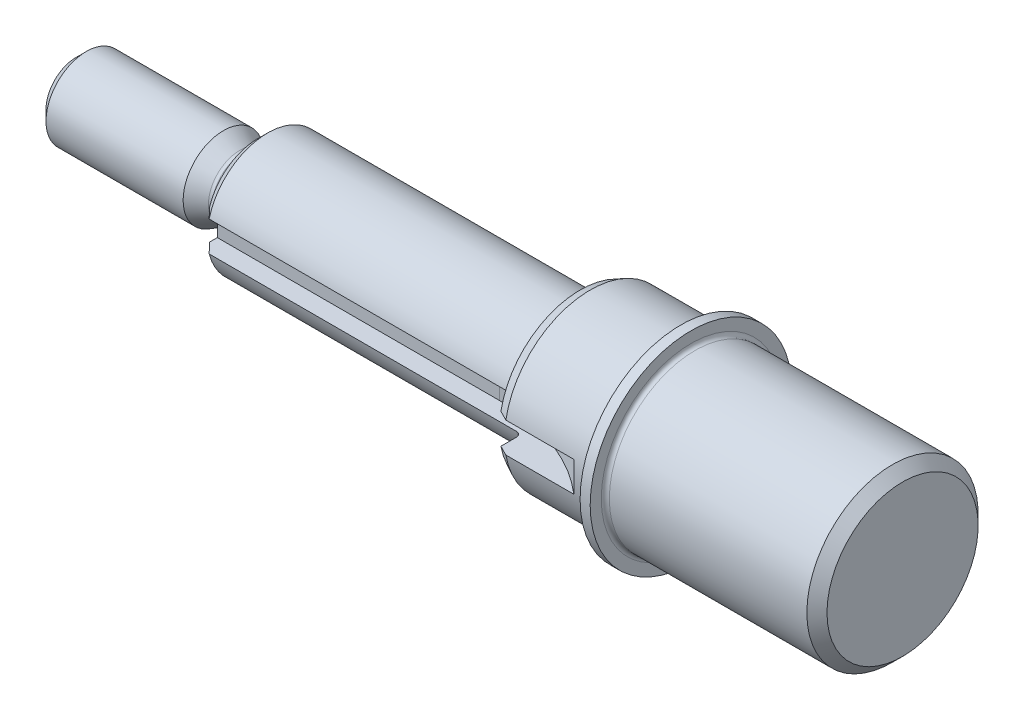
ISO-10303-21;
HEADER;
FILE_DESCRIPTION(('STEP AP214'),'2;1');
FILE_NAME('part.step','',(''),(''),'','','');
FILE_SCHEMA(('AUTOMOTIVE_DESIGN { 1 0 10303 214 1 1 1 1 }'));
ENDSEC;
DATA;
#1=APPLICATION_CONTEXT('core data for automotive mechanical design processes');
#2=APPLICATION_PROTOCOL_DEFINITION('international standard','automotive_design',2000,#1);
#3=PRODUCT_CONTEXT('',#1,'mechanical');
#4=PRODUCT('Part','Part','',(#3));
#5=PRODUCT_RELATED_PRODUCT_CATEGORY('part','',(#4));
#6=PRODUCT_DEFINITION_FORMATION('','',#4);
#7=PRODUCT_DEFINITION_CONTEXT('part definition',#1,'design');
#8=PRODUCT_DEFINITION('design','',#6,#7);
#9=PRODUCT_DEFINITION_SHAPE('','',#8);
#10=(LENGTH_UNIT() NAMED_UNIT(*) SI_UNIT(.MILLI.,.METRE.));
#11=(NAMED_UNIT(*) PLANE_ANGLE_UNIT() SI_UNIT($,.RADIAN.));
#12=(NAMED_UNIT(*) SI_UNIT($,.STERADIAN.) SOLID_ANGLE_UNIT());
#13=UNCERTAINTY_MEASURE_WITH_UNIT(LENGTH_MEASURE(1.E-05),#10,'distance_accuracy_value','');
#14=(GEOMETRIC_REPRESENTATION_CONTEXT(3) GLOBAL_UNCERTAINTY_ASSIGNED_CONTEXT((#13)) GLOBAL_UNIT_ASSIGNED_CONTEXT((#10,
#11,#12)) REPRESENTATION_CONTEXT('',''));
#15=CARTESIAN_POINT('',(0.,0.,0.));
#16=DIRECTION('',(0.,0.,1.));
#17=DIRECTION('',(1.,0.,0.));
#18=AXIS2_PLACEMENT_3D('',#15,#16,#17);
#19=CARTESIAN_POINT('',(0.,0.,0.));
#20=DIRECTION('',(-1.,0.,0.));
#21=DIRECTION('',(0.,0.,1.));
#22=AXIS2_PLACEMENT_3D('',#19,#20,#21);
#23=PLANE('',#22);
#24=CARTESIAN_POINT('',(0.,0.,0.));
#25=DIRECTION('',(-1.,0.,0.));
#26=DIRECTION('',(0.,0.,1.));
#27=AXIS2_PLACEMENT_3D('',#24,#25,#26);
#28=CIRCLE('',#27,7.5);
#29=CARTESIAN_POINT('',(0.,0.,7.5));
#30=VERTEX_POINT('',#29);
#31=EDGE_CURVE('E26',#30,#30,#28,.T.);
#32=ORIENTED_EDGE('',*,*,#31,.F.);
#33=EDGE_LOOP('',(#32));
#34=FACE_BOUND('',#33,.T.);
#35=ADVANCED_FACE('F14',(#34),#23,.F.);
#36=CARTESIAN_POINT('',(0.,0.,0.));
#37=DIRECTION('',(-1.,0.,0.));
#38=DIRECTION('',(0.,0.,1.));
#39=AXIS2_PLACEMENT_3D('',#36,#37,#38);
#40=CONICAL_SURFACE('',#39,7.5,0.785398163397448);
#41=CARTESIAN_POINT('',(-1.,0.,0.));
#42=DIRECTION('',(-1.,0.,0.));
#43=DIRECTION('',(0.,0.,1.));
#44=AXIS2_PLACEMENT_3D('',#41,#42,#43);
#45=CIRCLE('',#44,8.5);
#46=CARTESIAN_POINT('',(-1.,0.,8.5));
#47=VERTEX_POINT('',#46);
#48=EDGE_CURVE('E220',#47,#47,#45,.T.);
#49=ORIENTED_EDGE('',*,*,#48,.F.);
#50=EDGE_LOOP('',(#49));
#51=FACE_BOUND('',#50,.T.);
#52=ORIENTED_EDGE('',*,*,#31,.T.);
#53=EDGE_LOOP('',(#52));
#54=FACE_BOUND('',#53,.T.);
#55=ADVANCED_FACE('F225',(#51,#54),#40,.T.);
#56=CARTESIAN_POINT('',(-25.,0.,0.));
#57=DIRECTION('',(-1.,0.,0.));
#58=DIRECTION('',(0.,0.,1.));
#59=AXIS2_PLACEMENT_3D('',#56,#57,#58);
#60=CYLINDRICAL_SURFACE('',#59,8.5);
#61=CARTESIAN_POINT('',(-20.6,0.,0.));
#62=DIRECTION('',(-1.,0.,0.));
#63=DIRECTION('',(0.,0.,1.));
#64=AXIS2_PLACEMENT_3D('',#61,#62,#63);
#65=CIRCLE('',#64,8.5);
#66=CARTESIAN_POINT('',(-20.6,0.,8.5));
#67=VERTEX_POINT('',#66);
#68=EDGE_CURVE('E217',#67,#67,#65,.T.);
#69=ORIENTED_EDGE('',*,*,#68,.F.);
#70=EDGE_LOOP('',(#69));
#71=FACE_BOUND('',#70,.T.);
#72=ORIENTED_EDGE('',*,*,#48,.T.);
#73=EDGE_LOOP('',(#72));
#74=FACE_BOUND('',#73,.T.);
#75=ADVANCED_FACE('F233',(#71,#74),#60,.T.);
#76=CARTESIAN_POINT('',(-20.6,0.,0.));
#77=DIRECTION('',(-1.,0.,0.));
#78=DIRECTION('',(0.,0.,1.));
#79=AXIS2_PLACEMENT_3D('',#76,#77,#78);
#80=TOROIDAL_SURFACE('',#79,8.9,0.4);
#81=CARTESIAN_POINT('',(-21.,0.,0.));
#82=DIRECTION('',(-1.,0.,0.));
#83=DIRECTION('',(0.,0.,1.));
#84=AXIS2_PLACEMENT_3D('',#81,#82,#83);
#85=CIRCLE('',#84,8.9);
#86=CARTESIAN_POINT('',(-21.,0.,8.9));
#87=VERTEX_POINT('',#86);
#88=EDGE_CURVE('E214',#87,#87,#85,.T.);
#89=ORIENTED_EDGE('',*,*,#88,.F.);
#90=EDGE_LOOP('',(#89));
#91=FACE_BOUND('',#90,.T.);
#92=ORIENTED_EDGE('',*,*,#68,.T.);
#93=EDGE_LOOP('',(#92));
#94=FACE_BOUND('',#93,.T.);
#95=ADVANCED_FACE('F393',(#91,#94),#80,.F.);
#96=CARTESIAN_POINT('',(-21.,0.,8.9));
#97=DIRECTION('',(-1.,0.,0.));
#98=DIRECTION('',(0.,0.,1.));
#99=AXIS2_PLACEMENT_3D('',#96,#97,#98);
#100=PLANE('',#99);
#101=CARTESIAN_POINT('',(-21.,0.,0.));
#102=DIRECTION('',(-1.,0.,0.));
#103=DIRECTION('',(0.,0.,1.));
#104=AXIS2_PLACEMENT_3D('',#101,#102,#103);
#105=CIRCLE('',#104,10.);
#106=CARTESIAN_POINT('',(-21.,0.,10.));
#107=VERTEX_POINT('',#106);
#108=EDGE_CURVE('E211',#107,#107,#105,.T.);
#109=ORIENTED_EDGE('',*,*,#108,.F.);
#110=EDGE_LOOP('',(#109));
#111=FACE_BOUND('',#110,.T.);
#112=ORIENTED_EDGE('',*,*,#88,.T.);
#113=EDGE_LOOP('',(#112));
#114=FACE_BOUND('',#113,.T.);
#115=ADVANCED_FACE('F382',(#111,#114),#100,.F.);
#116=CARTESIAN_POINT('',(-25.,0.,0.));
#117=DIRECTION('',(-1.,0.,0.));
#118=DIRECTION('',(0.,0.,1.));
#119=AXIS2_PLACEMENT_3D('',#116,#117,#118);
#120=CYLINDRICAL_SURFACE('',#119,10.);
#121=CARTESIAN_POINT('',(-22.,0.,0.));
#122=DIRECTION('',(-1.,0.,0.));
#123=DIRECTION('',(0.,0.,1.));
#124=AXIS2_PLACEMENT_3D('',#121,#122,#123);
#125=CIRCLE('',#124,10.);
#126=CARTESIAN_POINT('',(-22.,0.,10.));
#127=VERTEX_POINT('',#126);
#128=EDGE_CURVE('E208',#127,#127,#125,.T.);
#129=ORIENTED_EDGE('',*,*,#128,.F.);
#130=EDGE_LOOP('',(#129));
#131=FACE_BOUND('',#130,.T.);
#132=ORIENTED_EDGE('',*,*,#108,.T.);
#133=EDGE_LOOP('',(#132));
#134=FACE_BOUND('',#133,.T.);
#135=ADVANCED_FACE('F371',(#131,#134),#120,.T.);
#136=CARTESIAN_POINT('',(-22.,0.,10.));
#137=DIRECTION('',(1.,0.,0.));
#138=DIRECTION('',(0.,0.,-1.));
#139=AXIS2_PLACEMENT_3D('',#136,#137,#138);
#140=PLANE('',#139);
#141=CARTESIAN_POINT('',(-22.,0.,0.));
#142=DIRECTION('',(-1.,0.,0.));
#143=DIRECTION('',(0.,0.,1.));
#144=AXIS2_PLACEMENT_3D('',#141,#142,#143);
#145=CIRCLE('',#144,8.89999999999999);
#146=CARTESIAN_POINT('',(-22.,0.,8.89999999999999));
#147=VERTEX_POINT('',#146);
#148=EDGE_CURVE('E205',#147,#147,#145,.T.);
#149=ORIENTED_EDGE('',*,*,#148,.F.);
#150=EDGE_LOOP('',(#149));
#151=FACE_BOUND('',#150,.T.);
#152=ORIENTED_EDGE('',*,*,#128,.T.);
#153=EDGE_LOOP('',(#152));
#154=FACE_BOUND('',#153,.T.);
#155=ADVANCED_FACE('F360',(#151,#154),#140,.F.);
#156=CARTESIAN_POINT('',(-22.4,0.,0.));
#157=DIRECTION('',(-1.,0.,0.));
#158=DIRECTION('',(0.,0.,1.));
#159=AXIS2_PLACEMENT_3D('',#156,#157,#158);
#160=TOROIDAL_SURFACE('',#159,8.89999999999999,0.4);
#161=CARTESIAN_POINT('',(-22.4,0.,0.));
#162=DIRECTION('',(-1.,0.,0.));
#163=DIRECTION('',(0.,0.,1.));
#164=AXIS2_PLACEMENT_3D('',#161,#162,#163);
#165=CIRCLE('',#164,8.49999999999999);
#166=CARTESIAN_POINT('',(-22.4,0.,8.49999999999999));
#167=VERTEX_POINT('',#166);
#168=EDGE_CURVE('E202',#167,#167,#165,.T.);
#169=ORIENTED_EDGE('',*,*,#168,.F.);
#170=EDGE_LOOP('',(#169));
#171=FACE_BOUND('',#170,.T.);
#172=ORIENTED_EDGE('',*,*,#148,.T.);
#173=EDGE_LOOP('',(#172));
#174=FACE_BOUND('',#173,.T.);
#175=ADVANCED_FACE('F242',(#171,#174),#160,.F.);
#176=CARTESIAN_POINT('',(-25.,0.,0.));
#177=DIRECTION('',(-1.,0.,0.));
#178=DIRECTION('',(0.,0.,1.));
#179=AXIS2_PLACEMENT_3D('',#176,#177,#178);
#180=CYLINDRICAL_SURFACE('',#179,8.49999999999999);
#181=CARTESIAN_POINT('',(-24.247110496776,-1.5,8.36660026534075));
#182=CARTESIAN_POINT('',(-24.2148062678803,-1.344734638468,8.39446859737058));
#183=CARTESIAN_POINT('',(-24.1875593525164,-1.18765509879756,8.41813852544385));
#184=CARTESIAN_POINT('',(-24.1432884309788,-0.87095220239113,8.45675809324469));
#185=CARTESIAN_POINT('',(-24.1262677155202,-0.711328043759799,8.47170492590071));
#186=CARTESIAN_POINT('',(-24.1028410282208,-0.394276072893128,8.49230552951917));
#187=CARTESIAN_POINT('',(-24.0962080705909,-0.23687803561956,8.49815800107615));
#188=CARTESIAN_POINT('',(-24.0928717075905,0.0780273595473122,8.50109981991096));
#189=CARTESIAN_POINT('',(-24.0961642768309,0.235534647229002,8.49819271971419));
#190=CARTESIAN_POINT('',(-24.1141738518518,0.578448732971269,8.48233285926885));
#191=CARTESIAN_POINT('',(-24.1308729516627,0.763681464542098,8.46763761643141));
#192=CARTESIAN_POINT('',(-24.1663727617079,1.04037355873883,8.43661167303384));
#193=CARTESIAN_POINT('',(-24.1800763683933,1.13303150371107,8.42466092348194));
#194=CARTESIAN_POINT('',(-24.210979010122,1.31732635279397,8.39781649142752));
#195=CARTESIAN_POINT('',(-24.22817780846,1.408963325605,8.38292300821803));
#196=CARTESIAN_POINT('',(-24.247110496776,1.5,8.36660026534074));
#197=B_SPLINE_CURVE_WITH_KNOTS('',3,(#181,#182,#183,#184,#185,#186,#187,#188,#189,#190,#191,
#192,#193,#194,#195,#196),.UNSPECIFIED.,.F.,.F.,(4,2,2,2,2,2,2,4),(0.,0.482930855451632,
0.966017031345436,1.43839207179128,1.9105755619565,2.46924658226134,2.75242328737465,
3.03558082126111),.UNSPECIFIED.);
#198=CARTESIAN_POINT('',(-24.247110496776,-1.5,8.36660026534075));
#199=VERTEX_POINT('',#198);
#200=CARTESIAN_POINT('',(-24.247110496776,1.5,8.36660026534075));
#201=VERTEX_POINT('',#200);
#202=EDGE_CURVE('E9',#199,#201,#197,.T.);
#203=ORIENTED_EDGE('',*,*,#202,.F.);
#204=DIRECTION('',(-1.,0.,0.));
#205=VECTOR('',#204,1.);
#206=CARTESIAN_POINT('',(-25.,-1.5,8.36660026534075));
#207=LINE('',#206,#205);
#208=CARTESIAN_POINT('',(-31.,-1.5,8.36660026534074));
#209=VERTEX_POINT('',#208);
#210=EDGE_CURVE('E177',#199,#209,#207,.T.);
#211=ORIENTED_EDGE('',*,*,#210,.T.);
#212=CARTESIAN_POINT('',(-31.,0.,0.));
#213=DIRECTION('',(-1.,0.,0.));
#214=DIRECTION('',(0.,0.,1.));
#215=AXIS2_PLACEMENT_3D('',#212,#213,#214);
#216=CIRCLE('',#215,8.49999999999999);
#217=CARTESIAN_POINT('',(-31.,1.5,8.36660026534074));
#218=VERTEX_POINT('',#217);
#219=EDGE_CURVE('E199',#218,#209,#216,.T.);
#220=ORIENTED_EDGE('',*,*,#219,.F.);
#221=DIRECTION('',(-1.,0.,0.));
#222=VECTOR('',#221,1.);
#223=CARTESIAN_POINT('',(-25.,1.5,8.36660026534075));
#224=LINE('',#223,#222);
#225=EDGE_CURVE('E268',#201,#218,#224,.T.);
#226=ORIENTED_EDGE('',*,*,#225,.F.);
#227=EDGE_LOOP('',(#203,#211,#220,#226));
#228=FACE_BOUND('',#227,.T.);
#229=ORIENTED_EDGE('',*,*,#168,.T.);
#230=EDGE_LOOP('',(#229));
#231=FACE_BOUND('',#230,.T.);
#232=ADVANCED_FACE('F237',(#228,#231),#180,.T.);
#233=CARTESIAN_POINT('',(-31.,0.,0.));
#234=DIRECTION('',(1.,0.,0.));
#235=DIRECTION('',(0.,0.,-1.));
#236=AXIS2_PLACEMENT_3D('',#233,#234,#235);
#237=CONICAL_SURFACE('',#236,8.49999999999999,0.4636476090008);
#238=ORIENTED_EDGE('',*,*,#219,.T.);
#239=CARTESIAN_POINT('',(-23.8627978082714,-1.5,11.9750211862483));
#240=CARTESIAN_POINT('',(-24.5056123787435,-1.5,11.6510934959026));
#241=CARTESIAN_POINT('',(-25.148352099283,-1.5,11.3270170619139));
#242=CARTESIAN_POINT('',(-26.4336195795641,-1.5,10.6784438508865));
#243=CARTESIAN_POINT('',(-27.076147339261,-1.5,10.3539470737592));
#244=CARTESIAN_POINT('',(-28.3609157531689,-1.5,9.70441683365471));
#245=CARTESIAN_POINT('',(-29.0031564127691,-1.5,9.37938338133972));
#246=CARTESIAN_POINT('',(-30.2872654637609,-1.5,8.72857844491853));
#247=CARTESIAN_POINT('',(-30.9291338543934,-1.5,8.40280695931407));
#248=CARTESIAN_POINT('',(-32.2123612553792,-1.5,7.75022173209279));
#249=CARTESIAN_POINT('',(-32.8537202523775,-1.5,7.42340796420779));
#250=CARTESIAN_POINT('',(-34.1356668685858,-1.5,6.76827674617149));
#251=CARTESIAN_POINT('',(-34.7762544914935,-1.5,6.43995930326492));
#252=CARTESIAN_POINT('',(-35.7362346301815,-1.5,5.94571337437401));
#253=CARTESIAN_POINT('',(-36.0560815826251,-1.5,5.78066780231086));
#254=CARTESIAN_POINT('',(-36.6953784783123,-1.5,5.44981091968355));
#255=CARTESIAN_POINT('',(-37.0148284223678,-1.5,5.28399961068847));
#256=CARTESIAN_POINT('',(-37.6532178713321,-1.5,4.95138324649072));
#257=CARTESIAN_POINT('',(-37.9721573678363,-1.5,4.78457817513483));
#258=CARTESIAN_POINT('',(-38.6093132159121,-1.5,4.449587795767));
#259=CARTESIAN_POINT('',(-38.9275295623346,-1.5,4.2814024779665));
#260=CARTESIAN_POINT('',(-39.2452783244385,-1.5,4.11233363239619));
#261=B_SPLINE_CURVE_WITH_KNOTS('',3,(#239,#240,#241,#242,#243,#244,#245,#246,#247,#248,#249,
#250,#251,#252,#253,#254,#255,#256,#257,#258,#259,#260),.UNSPECIFIED.,.F.,.F.,(4,2,2,2,2,2,2,2,
2,2,4),(0.,2.15945780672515,4.31891606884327,6.47833193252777,8.63775218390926,10.7972272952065,
12.9566920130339,14.0364499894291,15.1162057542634,16.1959791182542,17.2757601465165),.UNSPECIFIED.);
#262=CARTESIAN_POINT('',(-32.,-1.5,7.85811682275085));
#263=VERTEX_POINT('',#262);
#264=EDGE_CURVE('E39',#209,#263,#261,.T.);
#265=ORIENTED_EDGE('',*,*,#264,.T.);
#266=CARTESIAN_POINT('',(-32.,0.,0.));
#267=DIRECTION('',(-1.,0.,0.));
#268=DIRECTION('',(0.,0.,1.));
#269=AXIS2_PLACEMENT_3D('',#266,#267,#268);
#270=CIRCLE('',#269,7.99999999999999);
#271=CARTESIAN_POINT('',(-32.,1.5,7.85811682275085));
#272=VERTEX_POINT('',#271);
#273=EDGE_CURVE('E196',#272,#263,#270,.T.);
#274=ORIENTED_EDGE('',*,*,#273,.F.);
#275=CARTESIAN_POINT('',(-23.8627978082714,1.5,11.9750211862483));
#276=CARTESIAN_POINT('',(-24.5056123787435,1.5,11.6510934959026));
#277=CARTESIAN_POINT('',(-25.148352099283,1.5,11.3270170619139));
#278=CARTESIAN_POINT('',(-26.4336195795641,1.5,10.6784438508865));
#279=CARTESIAN_POINT('',(-27.076147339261,1.5,10.3539470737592));
#280=CARTESIAN_POINT('',(-28.3609157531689,1.5,9.70441683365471));
#281=CARTESIAN_POINT('',(-29.0031564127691,1.5,9.37938338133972));
#282=CARTESIAN_POINT('',(-30.2872654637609,1.5,8.72857844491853));
#283=CARTESIAN_POINT('',(-30.9291338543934,1.5,8.40280695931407));
#284=CARTESIAN_POINT('',(-32.2123612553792,1.5,7.75022173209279));
#285=CARTESIAN_POINT('',(-32.8537202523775,1.5,7.42340796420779));
#286=CARTESIAN_POINT('',(-34.1356668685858,1.5,6.76827674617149));
#287=CARTESIAN_POINT('',(-34.7762544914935,1.5,6.43995930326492));
#288=CARTESIAN_POINT('',(-35.7362346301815,1.5,5.94571337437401));
#289=CARTESIAN_POINT('',(-36.0560815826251,1.5,5.78066780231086));
#290=CARTESIAN_POINT('',(-36.6953784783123,1.5,5.44981091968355));
#291=CARTESIAN_POINT('',(-37.0148284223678,1.5,5.28399961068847));
#292=CARTESIAN_POINT('',(-37.6532178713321,1.5,4.95138324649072));
#293=CARTESIAN_POINT('',(-37.9721573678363,1.5,4.78457817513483));
#294=CARTESIAN_POINT('',(-38.6093132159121,1.5,4.449587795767));
#295=CARTESIAN_POINT('',(-38.9275295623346,1.5,4.2814024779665));
#296=CARTESIAN_POINT('',(-39.2452783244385,1.5,4.11233363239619));
#297=B_SPLINE_CURVE_WITH_KNOTS('',3,(#275,#276,#277,#278,#279,#280,#281,#282,#283,#284,#285,
#286,#287,#288,#289,#290,#291,#292,#293,#294,#295,#296),.UNSPECIFIED.,.F.,.F.,(4,2,2,2,2,2,2,2,
2,2,4),(0.,2.15945780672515,4.31891606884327,6.47833193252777,8.63775218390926,10.7972272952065,
12.9566920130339,14.0364499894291,15.1162057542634,16.1959791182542,17.2757601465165),.UNSPECIFIED.);
#298=EDGE_CURVE('E269',#218,#272,#297,.T.);
#299=ORIENTED_EDGE('',*,*,#298,.F.);
#300=EDGE_LOOP('',(#238,#265,#274,#299));
#301=FACE_BOUND('',#300,.T.);
#302=ADVANCED_FACE('F241',(#301),#237,.T.);
#303=CARTESIAN_POINT('',(-32.,0.,7.99999999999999));
#304=DIRECTION('',(1.,0.,0.));
#305=DIRECTION('',(0.,0.,-1.));
#306=AXIS2_PLACEMENT_3D('',#303,#304,#305);
#307=PLANE('',#306);
#308=ORIENTED_EDGE('',*,*,#273,.T.);
#309=DIRECTION('',(0.,0.,-1.));
#310=VECTOR('',#309,1.);
#311=CARTESIAN_POINT('',(-32.,-1.5,7.99999999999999));
#312=LINE('',#311,#310);
#313=CARTESIAN_POINT('',(-31.9999999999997,-1.5,6.32455532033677));
#314=VERTEX_POINT('',#313);
#315=EDGE_CURVE('E168',#263,#314,#312,.T.);
#316=ORIENTED_EDGE('',*,*,#315,.T.);
#317=CARTESIAN_POINT('',(-32.,0.,0.));
#318=DIRECTION('',(-1.,0.,0.));
#319=DIRECTION('',(0.,0.,1.));
#320=AXIS2_PLACEMENT_3D('',#317,#318,#319);
#321=CIRCLE('',#320,6.49999999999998);
#322=CARTESIAN_POINT('',(-31.9999999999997,1.5,6.32455532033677));
#323=VERTEX_POINT('',#322);
#324=EDGE_CURVE('E193',#323,#314,#321,.T.);
#325=ORIENTED_EDGE('',*,*,#324,.F.);
#326=DIRECTION('',(0.,0.,-1.));
#327=VECTOR('',#326,1.);
#328=CARTESIAN_POINT('',(-32.,1.5,7.99999999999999));
#329=LINE('',#328,#327);
#330=EDGE_CURVE('E155',#272,#323,#329,.T.);
#331=ORIENTED_EDGE('',*,*,#330,.F.);
#332=EDGE_LOOP('',(#308,#316,#325,#331));
#333=FACE_BOUND('',#332,.T.);
#334=ADVANCED_FACE('F246',(#333),#307,.F.);
#335=CARTESIAN_POINT('',(-32.5,0.,0.));
#336=DIRECTION('',(-1.,0.,0.));
#337=DIRECTION('',(0.,0.,1.));
#338=AXIS2_PLACEMENT_3D('',#335,#336,#337);
#339=TOROIDAL_SURFACE('',#338,6.49999999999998,0.5);
#340=ORIENTED_EDGE('',*,*,#324,.T.);
#341=CARTESIAN_POINT('',(-32.3073313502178,-1.5,5.84934493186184));
#342=CARTESIAN_POINT('',(-32.3324143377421,-1.5,5.83853300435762));
#343=CARTESIAN_POINT('',(-32.3584161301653,-1.5,5.82980896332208));
#344=CARTESIAN_POINT('',(-32.4115331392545,-1.5,5.8168399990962));
#345=CARTESIAN_POINT('',(-32.4386493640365,-1.5,5.81259922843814));
#346=CARTESIAN_POINT('',(-32.4932089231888,-1.5,5.80875137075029));
#347=CARTESIAN_POINT('',(-32.5206522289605,-1.5,5.80914388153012));
#348=CARTESIAN_POINT('',(-32.5750733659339,-1.5,5.81454894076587));
#349=CARTESIAN_POINT('',(-32.6020512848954,-1.5,5.81956060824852));
#350=CARTESIAN_POINT('',(-32.6547042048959,-1.5,5.83400924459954));
#351=CARTESIAN_POINT('',(-32.6803829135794,-1.5,5.84343272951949));
#352=CARTESIAN_POINT('',(-32.7298296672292,-1.5,5.86639166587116));
#353=CARTESIAN_POINT('',(-32.7535975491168,-1.5,5.87992746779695));
#354=CARTESIAN_POINT('',(-32.7989656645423,-1.5,5.91093447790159));
#355=CARTESIAN_POINT('',(-32.8205254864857,-1.5,5.92846476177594));
#356=CARTESIAN_POINT('',(-32.860498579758,-1.5,5.96680401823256));
#357=CARTESIAN_POINT('',(-32.8789114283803,-1.5,5.98761343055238));
#358=CARTESIAN_POINT('',(-32.9126299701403,-1.5,6.03255486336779));
#359=CARTESIAN_POINT('',(-32.9278315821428,-1.5,6.0567649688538));
#360=CARTESIAN_POINT('',(-32.9540805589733,-1.5,6.10734091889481));
#361=CARTESIAN_POINT('',(-32.9651273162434,-1.5,6.13370707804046));
#362=CARTESIAN_POINT('',(-32.9830508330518,-1.5,6.18861886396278));
#363=CARTESIAN_POINT('',(-32.9898057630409,-1.5,6.21720430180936));
#364=CARTESIAN_POINT('',(-32.9984941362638,-1.5,6.2750997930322));
#365=CARTESIAN_POINT('',(-33.0004271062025,-1.5,6.30440991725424));
#366=CARTESIAN_POINT('',(-32.9994082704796,-1.5,6.36335199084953));
#367=CARTESIAN_POINT('',(-32.9963887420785,-1.5,6.39298280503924));
#368=CARTESIAN_POINT('',(-32.985396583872,-1.5,6.45131287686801));
#369=CARTESIAN_POINT('',(-32.9774239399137,-1.5,6.48001213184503));
#370=CARTESIAN_POINT('',(-32.956759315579,-1.5,6.53551455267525));
#371=CARTESIAN_POINT('',(-32.9440885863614,-1.5,6.56232561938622));
#372=CARTESIAN_POINT('',(-32.9143414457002,-1.5,6.61338291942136));
#373=CARTESIAN_POINT('',(-32.8972654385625,-1.5,6.63762938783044));
#374=CARTESIAN_POINT('',(-32.8595303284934,-1.5,6.68236322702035));
#375=CARTESIAN_POINT('',(-32.8389458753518,-1.5,6.70291353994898));
#376=CARTESIAN_POINT('',(-32.7945430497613,-1.5,6.74016041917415));
#377=CARTESIAN_POINT('',(-32.7707251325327,-1.5,6.75685752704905));
#378=CARTESIAN_POINT('',(-32.7211604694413,-1.5,6.78549131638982));
#379=CARTESIAN_POINT('',(-32.6954753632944,-1.5,6.7975347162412));
#380=CARTESIAN_POINT('',(-32.6424203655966,-1.5,6.81703831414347));
#381=CARTESIAN_POINT('',(-32.6150506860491,-1.5,6.82449908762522));
#382=CARTESIAN_POINT('',(-32.5599889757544,-1.5,6.83448921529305));
#383=CARTESIAN_POINT('',(-32.5323141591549,-1.5,6.83711362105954));
#384=CARTESIAN_POINT('',(-32.4769207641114,-1.5,6.83763705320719));
#385=CARTESIAN_POINT('',(-32.4492021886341,-1.5,6.83553638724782));
#386=CARTESIAN_POINT('',(-32.3947421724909,-1.5,6.82671460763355));
#387=CARTESIAN_POINT('',(-32.3679946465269,-1.5,6.82003096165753));
#388=CARTESIAN_POINT('',(-32.3159912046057,-1.5,6.80229451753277));
#389=CARTESIAN_POINT('',(-32.2907353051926,-1.5,6.79124167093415));
#390=CARTESIAN_POINT('',(-32.2422546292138,-1.5,6.76502824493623));
#391=CARTESIAN_POINT('',(-32.2190432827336,-1.5,6.74984284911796));
#392=CARTESIAN_POINT('',(-32.1754416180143,-1.5,6.71585545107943));
#393=CARTESIAN_POINT('',(-32.1550515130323,-1.5,6.6970531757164));
#394=CARTESIAN_POINT('',(-32.1172685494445,-1.5,6.65601106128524));
#395=CARTESIAN_POINT('',(-32.0999365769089,-1.5,6.63371519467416));
#396=CARTESIAN_POINT('',(-32.069158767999,-1.5,6.58658672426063));
#397=CARTESIAN_POINT('',(-32.0557133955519,-1.5,6.56175381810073));
#398=CARTESIAN_POINT('',(-32.0327510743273,-1.5,6.50962221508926));
#399=CARTESIAN_POINT('',(-32.0233357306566,-1.5,6.48227876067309));
#400=CARTESIAN_POINT('',(-32.00912318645,-1.5,6.42641685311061));
#401=CARTESIAN_POINT('',(-32.0043265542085,-1.5,6.39789825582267));
#402=CARTESIAN_POINT('',(-31.999401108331,-1.5,6.33985469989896));
#403=CARTESIAN_POINT('',(-31.999372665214,-1.5,6.31032119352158));
#404=CARTESIAN_POINT('',(-32.0042261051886,-1.5,6.25166008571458));
#405=CARTESIAN_POINT('',(-32.0091081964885,-1.5,6.22253250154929));
#406=CARTESIAN_POINT('',(-32.0237237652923,-1.5,6.16524380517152));
#407=CARTESIAN_POINT('',(-32.0334997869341,-1.5,6.13709352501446));
#408=CARTESIAN_POINT('',(-32.0576840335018,-1.5,6.08284661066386));
#409=CARTESIAN_POINT('',(-32.072093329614,-1.5,6.05675045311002));
#410=CARTESIAN_POINT('',(-32.1050278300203,-1.5,6.0076281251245));
#411=CARTESIAN_POINT('',(-32.1235162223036,-1.5,5.98457727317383));
#412=CARTESIAN_POINT('',(-32.164179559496,-1.5,5.94203080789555));
#413=CARTESIAN_POINT('',(-32.1863494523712,-1.5,5.922530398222));
#414=CARTESIAN_POINT('',(-32.2251385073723,-1.5,5.89403834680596));
#415=CARTESIAN_POINT('',(-32.2408569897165,-1.5,5.88379959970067));
#416=CARTESIAN_POINT('',(-32.2733499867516,-1.5,5.86516139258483));
#417=CARTESIAN_POINT('',(-32.2901244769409,-1.5,5.85676188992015));
#418=CARTESIAN_POINT('',(-32.3073313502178,-1.5,5.84934493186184));
#419=B_SPLINE_CURVE_WITH_KNOTS('',3,(#341,#342,#343,#344,#345,#346,#347,#348,#349,#350,#351,
#352,#353,#354,#355,#356,#357,#358,#359,#360,#361,#362,#363,#364,#365,#366,#367,#368,#369,#370,
#371,#372,#373,#374,#375,#376,#377,#378,#379,#380,#381,#382,#383,#384,#385,#386,#387,#388,#389,
#390,#391,#392,#393,#394,#395,#396,#397,#398,#399,#400,#401,#402,#403,#404,#405,#406,#407,#408,
#409,#410,#411,#412,#413,#414,#415,#416,#417,#418),.UNSPECIFIED.,.T.,.F.,(4,2,2,2,2,2,2,2,2,2,2,
2,2,2,2,2,2,2,2,2,2,2,2,2,2,2,2,2,2,2,2,2,2,2,2,2,2,2,4),(0.,0.0818747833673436,
0.163825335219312,0.245768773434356,0.327696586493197,0.409375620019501,0.491061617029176,
0.574044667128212,0.657038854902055,0.742409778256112,0.827793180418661,0.915503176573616,
1.00322178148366,1.09214992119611,1.18107831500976,1.26960926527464,1.35813209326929,
1.44496448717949,1.5317846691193,1.61647532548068,1.70115534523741,1.78415259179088,
1.86714443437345,1.9494657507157,2.03178797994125,2.11461590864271,2.19745009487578,
2.28178260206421,2.36612517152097,2.45248418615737,2.53885382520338,2.62704132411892,
2.71523256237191,2.80420414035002,2.89319630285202,2.98141600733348,3.06951563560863,
3.1256828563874,3.18184877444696),.UNSPECIFIED.);
#420=CARTESIAN_POINT('',(-32.5,-1.5,5.80947501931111));
#421=VERTEX_POINT('',#420);
#422=EDGE_CURVE('E162',#314,#421,#419,.T.);
#423=ORIENTED_EDGE('',*,*,#422,.T.);
#424=CARTESIAN_POINT('',(-32.5,0.,0.));
#425=DIRECTION('',(-1.,0.,0.));
#426=DIRECTION('',(0.,0.,1.));
#427=AXIS2_PLACEMENT_3D('',#424,#425,#426);
#428=CIRCLE('',#427,5.99999999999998);
#429=CARTESIAN_POINT('',(-32.5,1.5,5.80947501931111));
#430=VERTEX_POINT('',#429);
#431=EDGE_CURVE('E190',#430,#421,#428,.T.);
#432=ORIENTED_EDGE('',*,*,#431,.F.);
#433=CARTESIAN_POINT('',(-32.3073313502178,1.5,5.84934493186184));
#434=CARTESIAN_POINT('',(-32.3324143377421,1.5,5.83853300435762));
#435=CARTESIAN_POINT('',(-32.3584161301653,1.5,5.82980896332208));
#436=CARTESIAN_POINT('',(-32.4115331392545,1.5,5.8168399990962));
#437=CARTESIAN_POINT('',(-32.4386493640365,1.5,5.81259922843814));
#438=CARTESIAN_POINT('',(-32.4932089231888,1.5,5.80875137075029));
#439=CARTESIAN_POINT('',(-32.5206522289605,1.5,5.80914388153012));
#440=CARTESIAN_POINT('',(-32.5750733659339,1.5,5.81454894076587));
#441=CARTESIAN_POINT('',(-32.6020512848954,1.5,5.81956060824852));
#442=CARTESIAN_POINT('',(-32.6547042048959,1.5,5.83400924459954));
#443=CARTESIAN_POINT('',(-32.6803829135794,1.5,5.84343272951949));
#444=CARTESIAN_POINT('',(-32.7298296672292,1.5,5.86639166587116));
#445=CARTESIAN_POINT('',(-32.7535975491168,1.5,5.87992746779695));
#446=CARTESIAN_POINT('',(-32.7989656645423,1.5,5.91093447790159));
#447=CARTESIAN_POINT('',(-32.8205254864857,1.5,5.92846476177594));
#448=CARTESIAN_POINT('',(-32.860498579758,1.5,5.96680401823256));
#449=CARTESIAN_POINT('',(-32.8789114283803,1.5,5.98761343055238));
#450=CARTESIAN_POINT('',(-32.9126299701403,1.5,6.03255486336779));
#451=CARTESIAN_POINT('',(-32.9278315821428,1.5,6.0567649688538));
#452=CARTESIAN_POINT('',(-32.9540805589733,1.5,6.10734091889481));
#453=CARTESIAN_POINT('',(-32.9651273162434,1.5,6.13370707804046));
#454=CARTESIAN_POINT('',(-32.9830508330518,1.5,6.18861886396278));
#455=CARTESIAN_POINT('',(-32.9898057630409,1.5,6.21720430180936));
#456=CARTESIAN_POINT('',(-32.9984941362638,1.5,6.2750997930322));
#457=CARTESIAN_POINT('',(-33.0004271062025,1.5,6.30440991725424));
#458=CARTESIAN_POINT('',(-32.9994082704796,1.5,6.36335199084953));
#459=CARTESIAN_POINT('',(-32.9963887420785,1.5,6.39298280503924));
#460=CARTESIAN_POINT('',(-32.985396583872,1.5,6.45131287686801));
#461=CARTESIAN_POINT('',(-32.9774239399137,1.5,6.48001213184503));
#462=CARTESIAN_POINT('',(-32.956759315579,1.5,6.53551455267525));
#463=CARTESIAN_POINT('',(-32.9440885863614,1.5,6.56232561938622));
#464=CARTESIAN_POINT('',(-32.9143414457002,1.5,6.61338291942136));
#465=CARTESIAN_POINT('',(-32.8972654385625,1.5,6.63762938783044));
#466=CARTESIAN_POINT('',(-32.8595303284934,1.5,6.68236322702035));
#467=CARTESIAN_POINT('',(-32.8389458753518,1.5,6.70291353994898));
#468=CARTESIAN_POINT('',(-32.7945430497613,1.5,6.74016041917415));
#469=CARTESIAN_POINT('',(-32.7707251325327,1.5,6.75685752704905));
#470=CARTESIAN_POINT('',(-32.7211604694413,1.5,6.78549131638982));
#471=CARTESIAN_POINT('',(-32.6954753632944,1.5,6.7975347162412));
#472=CARTESIAN_POINT('',(-32.6424203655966,1.5,6.81703831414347));
#473=CARTESIAN_POINT('',(-32.6150506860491,1.5,6.82449908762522));
#474=CARTESIAN_POINT('',(-32.5599889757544,1.5,6.83448921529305));
#475=CARTESIAN_POINT('',(-32.5323141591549,1.5,6.83711362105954));
#476=CARTESIAN_POINT('',(-32.4769207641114,1.5,6.83763705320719));
#477=CARTESIAN_POINT('',(-32.4492021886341,1.5,6.83553638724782));
#478=CARTESIAN_POINT('',(-32.3947421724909,1.5,6.82671460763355));
#479=CARTESIAN_POINT('',(-32.3679946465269,1.5,6.82003096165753));
#480=CARTESIAN_POINT('',(-32.3159912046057,1.5,6.80229451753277));
#481=CARTESIAN_POINT('',(-32.2907353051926,1.5,6.79124167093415));
#482=CARTESIAN_POINT('',(-32.2422546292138,1.5,6.76502824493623));
#483=CARTESIAN_POINT('',(-32.2190432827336,1.5,6.74984284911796));
#484=CARTESIAN_POINT('',(-32.1754416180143,1.5,6.71585545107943));
#485=CARTESIAN_POINT('',(-32.1550515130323,1.5,6.6970531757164));
#486=CARTESIAN_POINT('',(-32.1172685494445,1.5,6.65601106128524));
#487=CARTESIAN_POINT('',(-32.0999365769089,1.5,6.63371519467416));
#488=CARTESIAN_POINT('',(-32.069158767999,1.5,6.58658672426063));
#489=CARTESIAN_POINT('',(-32.0557133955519,1.5,6.56175381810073));
#490=CARTESIAN_POINT('',(-32.0327510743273,1.5,6.50962221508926));
#491=CARTESIAN_POINT('',(-32.0233357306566,1.5,6.48227876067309));
#492=CARTESIAN_POINT('',(-32.00912318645,1.5,6.42641685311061));
#493=CARTESIAN_POINT('',(-32.0043265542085,1.5,6.39789825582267));
#494=CARTESIAN_POINT('',(-31.999401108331,1.5,6.33985469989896));
#495=CARTESIAN_POINT('',(-31.999372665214,1.5,6.31032119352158));
#496=CARTESIAN_POINT('',(-32.0042261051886,1.5,6.25166008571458));
#497=CARTESIAN_POINT('',(-32.0091081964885,1.5,6.22253250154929));
#498=CARTESIAN_POINT('',(-32.0237237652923,1.5,6.16524380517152));
#499=CARTESIAN_POINT('',(-32.0334997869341,1.5,6.13709352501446));
#500=CARTESIAN_POINT('',(-32.0576840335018,1.5,6.08284661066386));
#501=CARTESIAN_POINT('',(-32.072093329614,1.5,6.05675045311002));
#502=CARTESIAN_POINT('',(-32.1050278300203,1.5,6.0076281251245));
#503=CARTESIAN_POINT('',(-32.1235162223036,1.5,5.98457727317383));
#504=CARTESIAN_POINT('',(-32.164179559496,1.5,5.94203080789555));
#505=CARTESIAN_POINT('',(-32.1863494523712,1.5,5.922530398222));
#506=CARTESIAN_POINT('',(-32.2251385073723,1.5,5.89403834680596));
#507=CARTESIAN_POINT('',(-32.2408569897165,1.5,5.88379959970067));
#508=CARTESIAN_POINT('',(-32.2733499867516,1.5,5.86516139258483));
#509=CARTESIAN_POINT('',(-32.2901244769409,1.5,5.85676188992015));
#510=CARTESIAN_POINT('',(-32.3073313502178,1.5,5.84934493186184));
#511=B_SPLINE_CURVE_WITH_KNOTS('',3,(#433,#434,#435,#436,#437,#438,#439,#440,#441,#442,#443,
#444,#445,#446,#447,#448,#449,#450,#451,#452,#453,#454,#455,#456,#457,#458,#459,#460,#461,#462,
#463,#464,#465,#466,#467,#468,#469,#470,#471,#472,#473,#474,#475,#476,#477,#478,#479,#480,#481,
#482,#483,#484,#485,#486,#487,#488,#489,#490,#491,#492,#493,#494,#495,#496,#497,#498,#499,#500,
#501,#502,#503,#504,#505,#506,#507,#508,#509,#510),.UNSPECIFIED.,.T.,.F.,(4,2,2,2,2,2,2,2,2,2,2,
2,2,2,2,2,2,2,2,2,2,2,2,2,2,2,2,2,2,2,2,2,2,2,2,2,2,2,4),(0.,0.0818747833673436,
0.163825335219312,0.245768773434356,0.327696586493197,0.409375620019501,0.491061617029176,
0.574044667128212,0.657038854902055,0.742409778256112,0.827793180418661,0.915503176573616,
1.00322178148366,1.09214992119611,1.18107831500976,1.26960926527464,1.35813209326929,
1.44496448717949,1.5317846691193,1.61647532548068,1.70115534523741,1.78415259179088,
1.86714443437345,1.9494657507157,2.03178797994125,2.11461590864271,2.19745009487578,
2.28178260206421,2.36612517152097,2.45248418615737,2.53885382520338,2.62704132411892,
2.71523256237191,2.80420414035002,2.89319630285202,2.98141600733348,3.06951563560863,
3.1256828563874,3.18184877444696),.UNSPECIFIED.);
#512=EDGE_CURVE('E151',#323,#430,#511,.T.);
#513=ORIENTED_EDGE('',*,*,#512,.F.);
#514=EDGE_LOOP('',(#340,#423,#432,#513));
#515=FACE_BOUND('',#514,.T.);
#516=ADVANCED_FACE('F248',(#515),#339,.F.);
#517=CARTESIAN_POINT('',(-25.,0.,0.));
#518=DIRECTION('',(-1.,0.,0.));
#519=DIRECTION('',(0.,0.,1.));
#520=AXIS2_PLACEMENT_3D('',#517,#518,#519);
#521=CYLINDRICAL_SURFACE('',#520,5.99999999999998);
#522=ORIENTED_EDGE('',*,*,#431,.T.);
#523=DIRECTION('',(-1.,0.,0.));
#524=VECTOR('',#523,1.);
#525=CARTESIAN_POINT('',(-25.,-1.5,5.80947501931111));
#526=LINE('',#525,#524);
#527=CARTESIAN_POINT('',(-63.,-1.5,5.80947501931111));
#528=VERTEX_POINT('',#527);
#529=EDGE_CURVE('E169',#421,#528,#526,.T.);
#530=ORIENTED_EDGE('',*,*,#529,.T.);
#531=CARTESIAN_POINT('',(-63.,0.,0.));
#532=DIRECTION('',(-1.,0.,0.));
#533=DIRECTION('',(0.,0.,1.));
#534=AXIS2_PLACEMENT_3D('',#531,#532,#533);
#535=CIRCLE('',#534,5.99999999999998);
#536=CARTESIAN_POINT('',(-63.,1.5,5.80947501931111));
#537=VERTEX_POINT('',#536);
#538=EDGE_CURVE('E187',#537,#528,#535,.T.);
#539=ORIENTED_EDGE('',*,*,#538,.F.);
#540=DIRECTION('',(-1.,0.,0.));
#541=VECTOR('',#540,1.);
#542=CARTESIAN_POINT('',(-25.,1.5,5.80947501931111));
#543=LINE('',#542,#541);
#544=EDGE_CURVE('E134',#430,#537,#543,.T.);
#545=ORIENTED_EDGE('',*,*,#544,.F.);
#546=EDGE_LOOP('',(#522,#530,#539,#545));
#547=FACE_BOUND('',#546,.T.);
#548=ADVANCED_FACE('F250',(#547),#521,.T.);
#549=CARTESIAN_POINT('',(-63.,0.,0.));
#550=DIRECTION('',(1.,0.,0.));
#551=DIRECTION('',(0.,0.,-1.));
#552=AXIS2_PLACEMENT_3D('',#549,#550,#551);
#553=CONICAL_SURFACE('',#552,5.99999999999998,0.785398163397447);
#554=ORIENTED_EDGE('',*,*,#538,.T.);
#555=CARTESIAN_POINT('',(-60.7942312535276,-1.5,8.06750523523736));
#556=CARTESIAN_POINT('',(-61.0537545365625,-1.5,7.80350487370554));
#557=CARTESIAN_POINT('',(-61.3130893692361,-1.5,7.53931820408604));
#558=CARTESIAN_POINT('',(-61.8311370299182,-1.5,7.01039001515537));
#559=CARTESIAN_POINT('',(-62.0898499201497,-1.5,6.74564855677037));
#560=CARTESIAN_POINT('',(-62.6063193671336,-1.5,6.21552082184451));
#561=CARTESIAN_POINT('',(-62.8640763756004,-1.5,5.95013498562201));
#562=CARTESIAN_POINT('',(-63.3784296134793,-1.5,5.4181835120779));
#563=CARTESIAN_POINT('',(-63.6350257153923,-1.5,5.15161775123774));
#564=CARTESIAN_POINT('',(-64.0186480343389,-1.5,4.75030399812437));
#565=CARTESIAN_POINT('',(-64.1463718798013,-1.5,4.61622309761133));
#566=CARTESIAN_POINT('',(-64.4012130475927,-1.5,4.34748990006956));
#567=CARTESIAN_POINT('',(-64.5283303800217,-1.5,4.21283761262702));
#568=CARTESIAN_POINT('',(-64.7817407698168,-1.5,3.94282688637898));
#569=CARTESIAN_POINT('',(-64.908034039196,-1.5,3.80746864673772));
#570=CARTESIAN_POINT('',(-65.159565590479,-1.5,3.53575786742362));
#571=CARTESIAN_POINT('',(-65.2848038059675,-1.5,3.3994052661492));
#572=CARTESIAN_POINT('',(-65.5339176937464,-1.5,3.12522199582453));
#573=CARTESIAN_POINT('',(-65.6577919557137,-1.5,2.98739004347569));
#574=CARTESIAN_POINT('',(-65.9033807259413,-1.5,2.70984588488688));
#575=CARTESIAN_POINT('',(-66.0250956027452,-1.5,2.57013400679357));
#576=CARTESIAN_POINT('',(-66.2052501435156,-1.5,2.35838663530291));
#577=CARTESIAN_POINT('',(-66.2649275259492,-1.5,2.28740537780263));
#578=CARTESIAN_POINT('',(-66.3832156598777,-1.5,2.14456612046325));
#579=CARTESIAN_POINT('',(-66.4418264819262,-1.5,2.07270817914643));
#580=CARTESIAN_POINT('',(-66.557722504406,-1.5,1.92785557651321));
#581=CARTESIAN_POINT('',(-66.6150069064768,-1.5,1.85486027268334));
#582=CARTESIAN_POINT('',(-66.7277405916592,-1.5,1.70744247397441));
#583=CARTESIAN_POINT('',(-66.7831894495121,-1.5,1.63301965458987));
#584=CARTESIAN_POINT('',(-66.8374702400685,-1.5,1.55773391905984));
#585=B_SPLINE_CURVE_WITH_KNOTS('',3,(#555,#556,#557,#558,#559,#560,#561,#562,#563,#564,#565,
#566,#567,#568,#569,#570,#571,#572,#573,#574,#575,#576,#577,#578,#579,#580,#581,#582,#583,#584),
.UNSPECIFIED.,.F.,.F.,(4,2,2,2,2,2,2,2,2,2,2,2,2,2,4),(0.,1.11060304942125,2.22108993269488,
3.33095943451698,4.44094800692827,4.99648207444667,5.55200685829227,6.10738258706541,
6.66279301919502,7.21873209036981,7.77457534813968,8.05277148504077,8.33094915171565,
8.60929011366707,8.88769511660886),.UNSPECIFIED.);
#586=CARTESIAN_POINT('',(-64.,-1.5,4.76969600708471));
#587=VERTEX_POINT('',#586);
#588=EDGE_CURVE('E264',#528,#587,#585,.T.);
#589=ORIENTED_EDGE('',*,*,#588,.T.);
#590=CARTESIAN_POINT('',(-64.,0.,0.));
#591=DIRECTION('',(-1.,0.,0.));
#592=DIRECTION('',(0.,0.,1.));
#593=AXIS2_PLACEMENT_3D('',#590,#591,#592);
#594=CIRCLE('',#593,4.99999999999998);
#595=CARTESIAN_POINT('',(-64.,1.5,4.76969600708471));
#596=VERTEX_POINT('',#595);
#597=EDGE_CURVE('E185',#596,#587,#594,.T.);
#598=ORIENTED_EDGE('',*,*,#597,.F.);
#599=CARTESIAN_POINT('',(-60.7942312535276,1.5,8.06750523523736));
#600=CARTESIAN_POINT('',(-61.0537545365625,1.5,7.80350487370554));
#601=CARTESIAN_POINT('',(-61.3130893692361,1.5,7.53931820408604));
#602=CARTESIAN_POINT('',(-61.8311370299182,1.5,7.01039001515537));
#603=CARTESIAN_POINT('',(-62.0898499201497,1.5,6.74564855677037));
#604=CARTESIAN_POINT('',(-62.6063193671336,1.5,6.21552082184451));
#605=CARTESIAN_POINT('',(-62.8640763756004,1.5,5.95013498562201));
#606=CARTESIAN_POINT('',(-63.3784296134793,1.5,5.4181835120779));
#607=CARTESIAN_POINT('',(-63.6350257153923,1.5,5.15161775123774));
#608=CARTESIAN_POINT('',(-64.0186480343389,1.5,4.75030399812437));
#609=CARTESIAN_POINT('',(-64.1463718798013,1.5,4.61622309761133));
#610=CARTESIAN_POINT('',(-64.4012130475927,1.5,4.34748990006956));
#611=CARTESIAN_POINT('',(-64.5283303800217,1.5,4.21283761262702));
#612=CARTESIAN_POINT('',(-64.7817407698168,1.5,3.94282688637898));
#613=CARTESIAN_POINT('',(-64.908034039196,1.5,3.80746864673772));
#614=CARTESIAN_POINT('',(-65.159565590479,1.5,3.53575786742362));
#615=CARTESIAN_POINT('',(-65.2848038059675,1.5,3.3994052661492));
#616=CARTESIAN_POINT('',(-65.5339176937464,1.5,3.12522199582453));
#617=CARTESIAN_POINT('',(-65.6577919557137,1.5,2.98739004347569));
#618=CARTESIAN_POINT('',(-65.9033807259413,1.5,2.70984588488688));
#619=CARTESIAN_POINT('',(-66.0250956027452,1.5,2.57013400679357));
#620=CARTESIAN_POINT('',(-66.2052501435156,1.5,2.35838663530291));
#621=CARTESIAN_POINT('',(-66.2649275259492,1.5,2.28740537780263));
#622=CARTESIAN_POINT('',(-66.3832156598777,1.5,2.14456612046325));
#623=CARTESIAN_POINT('',(-66.4418264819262,1.5,2.07270817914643));
#624=CARTESIAN_POINT('',(-66.557722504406,1.5,1.92785557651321));
#625=CARTESIAN_POINT('',(-66.6150069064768,1.5,1.85486027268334));
#626=CARTESIAN_POINT('',(-66.7277405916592,1.5,1.70744247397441));
#627=CARTESIAN_POINT('',(-66.7831894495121,1.5,1.63301965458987));
#628=CARTESIAN_POINT('',(-66.8374702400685,1.5,1.55773391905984));
#629=B_SPLINE_CURVE_WITH_KNOTS('',3,(#599,#600,#601,#602,#603,#604,#605,#606,#607,#608,#609,
#610,#611,#612,#613,#614,#615,#616,#617,#618,#619,#620,#621,#622,#623,#624,#625,#626,#627,#628),
.UNSPECIFIED.,.F.,.F.,(4,2,2,2,2,2,2,2,2,2,2,2,2,2,4),(0.,1.11060304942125,2.22108993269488,
3.33095943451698,4.44094800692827,4.99648207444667,5.55200685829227,6.10738258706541,
6.66279301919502,7.21873209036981,7.77457534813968,8.05277148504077,8.33094915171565,
8.60929011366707,8.88769511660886),.UNSPECIFIED.);
#630=EDGE_CURVE('E100',#537,#596,#629,.T.);
#631=ORIENTED_EDGE('',*,*,#630,.F.);
#632=EDGE_LOOP('',(#554,#589,#598,#631));
#633=FACE_BOUND('',#632,.T.);
#634=ADVANCED_FACE('F252',(#633),#553,.T.);
#635=CARTESIAN_POINT('',(-64.,0.,4.99999999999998));
#636=DIRECTION('',(1.,0.,0.));
#637=DIRECTION('',(0.,0.,-1.));
#638=AXIS2_PLACEMENT_3D('',#635,#636,#637);
#639=PLANE('',#638);
#640=DIRECTION('',(0.,1.,0.));
#641=VECTOR('',#640,1.);
#642=CARTESIAN_POINT('',(-64.,-1.5,4.));
#643=LINE('',#642,#641);
#644=CARTESIAN_POINT('',(-64.,-1.5,4.));
#645=VERTEX_POINT('',#644);
#646=CARTESIAN_POINT('',(-64.,1.5,4.));
#647=VERTEX_POINT('',#646);
#648=EDGE_CURVE('E89',#645,#647,#643,.T.);
#649=ORIENTED_EDGE('',*,*,#648,.T.);
#650=DIRECTION('',(0.,0.,-1.));
#651=VECTOR('',#650,1.);
#652=CARTESIAN_POINT('',(-64.,1.5,8.49999999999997));
#653=LINE('',#652,#651);
#654=EDGE_CURVE('E94',#596,#647,#653,.T.);
#655=ORIENTED_EDGE('',*,*,#654,.F.);
#656=ORIENTED_EDGE('',*,*,#597,.T.);
#657=DIRECTION('',(0.,0.,-1.));
#658=VECTOR('',#657,1.);
#659=CARTESIAN_POINT('',(-64.,-1.5,8.49999999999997));
#660=LINE('',#659,#658);
#661=EDGE_CURVE('E96',#587,#645,#660,.T.);
#662=ORIENTED_EDGE('',*,*,#661,.T.);
#663=EDGE_LOOP('',(#649,#655,#656,#662));
#664=FACE_BOUND('',#663,.T.);
#665=CARTESIAN_POINT('',(-64.,0.,0.));
#666=DIRECTION('',(-1.,0.,0.));
#667=DIRECTION('',(0.,0.,1.));
#668=AXIS2_PLACEMENT_3D('',#665,#666,#667);
#669=CIRCLE('',#668,3.59999999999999);
#670=CARTESIAN_POINT('',(-64.,0.,3.59999999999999));
#671=VERTEX_POINT('',#670);
#672=EDGE_CURVE('E737',#671,#671,#669,.T.);
#673=ORIENTED_EDGE('',*,*,#672,.F.);
#674=EDGE_LOOP('',(#673));
#675=FACE_BOUND('',#674,.T.);
#676=ADVANCED_FACE('F91',(#664,#675),#639,.F.);
#677=CARTESIAN_POINT('',(-64.,-1.5,4.));
#678=DIRECTION('',(0.,0.,1.));
#679=DIRECTION('',(1.,0.,0.));
#680=AXIS2_PLACEMENT_3D('',#677,#678,#679);
#681=PLANE('',#680);
#682=DIRECTION('',(1.,0.,0.));
#683=VECTOR('',#682,1.);
#684=CARTESIAN_POINT('',(-64.,1.5,4.));
#685=LINE('',#684,#683);
#686=CARTESIAN_POINT('',(-36.,1.5,4.));
#687=VERTEX_POINT('',#686);
#688=EDGE_CURVE('E106',#647,#687,#685,.T.);
#689=ORIENTED_EDGE('',*,*,#688,.F.);
#690=ORIENTED_EDGE('',*,*,#648,.F.);
#691=DIRECTION('',(1.,0.,0.));
#692=VECTOR('',#691,1.);
#693=CARTESIAN_POINT('',(-64.,-1.5,4.));
#694=LINE('',#693,#692);
#695=CARTESIAN_POINT('',(-36.,-1.5,4.));
#696=VERTEX_POINT('',#695);
#697=EDGE_CURVE('E124',#645,#696,#694,.T.);
#698=ORIENTED_EDGE('',*,*,#697,.T.);
#699=DIRECTION('',(0.,1.,0.));
#700=VECTOR('',#699,1.);
#701=CARTESIAN_POINT('',(-36.,-1.5,4.));
#702=LINE('',#701,#700);
#703=EDGE_CURVE('E101',#696,#687,#702,.T.);
#704=ORIENTED_EDGE('',*,*,#703,.T.);
#705=EDGE_LOOP('',(#689,#690,#698,#704));
#706=FACE_BOUND('',#705,.T.);
#707=ADVANCED_FACE('F112',(#706),#681,.T.);
#708=CARTESIAN_POINT('',(-36.,-1.5,22.));
#709=DIRECTION('',(0.,1.,0.));
#710=DIRECTION('',(0.,0.,1.));
#711=AXIS2_PLACEMENT_3D('',#708,#709,#710);
#712=CYLINDRICAL_SURFACE('',#711,18.);
#713=ORIENTED_EDGE('',*,*,#202,.T.);
#714=CARTESIAN_POINT('',(-36.,1.5,22.));
#715=DIRECTION('',(0.,-1.,0.));
#716=DIRECTION('',(1.,0.,0.));
#717=AXIS2_PLACEMENT_3D('',#714,#715,#716);
#718=CIRCLE('',#717,18.);
#719=EDGE_CURVE('E115',#687,#201,#718,.T.);
#720=ORIENTED_EDGE('',*,*,#719,.F.);
#721=ORIENTED_EDGE('',*,*,#703,.F.);
#722=CARTESIAN_POINT('',(-36.,-1.5,22.));
#723=DIRECTION('',(0.,-1.,0.));
#724=DIRECTION('',(1.,0.,0.));
#725=AXIS2_PLACEMENT_3D('',#722,#723,#724);
#726=CIRCLE('',#725,18.);
#727=EDGE_CURVE('E32',#696,#199,#726,.T.);
#728=ORIENTED_EDGE('',*,*,#727,.T.);
#729=EDGE_LOOP('',(#713,#720,#721,#728));
#730=FACE_BOUND('',#729,.T.);
#731=ADVANCED_FACE('F287',(#730),#712,.F.);
#732=CARTESIAN_POINT('',(-42.7737709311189,-1.5,9.88515019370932));
#733=DIRECTION('',(0.,-1.,0.));
#734=DIRECTION('',(0.,0.,-1.));
#735=AXIS2_PLACEMENT_3D('',#732,#733,#734);
#736=PLANE('',#735);
#737=ORIENTED_EDGE('',*,*,#727,.F.);
#738=ORIENTED_EDGE('',*,*,#697,.F.);
#739=ORIENTED_EDGE('',*,*,#661,.F.);
#740=ORIENTED_EDGE('',*,*,#588,.F.);
#741=ORIENTED_EDGE('',*,*,#529,.F.);
#742=ORIENTED_EDGE('',*,*,#422,.F.);
#743=ORIENTED_EDGE('',*,*,#315,.F.);
#744=ORIENTED_EDGE('',*,*,#264,.F.);
#745=ORIENTED_EDGE('',*,*,#210,.F.);
#746=EDGE_LOOP('',(#737,#738,#739,#740,#741,#742,#743,#744,#745));
#747=FACE_BOUND('',#746,.T.);
#748=ADVANCED_FACE('F144',(#747),#736,.F.);
#749=CARTESIAN_POINT('',(-42.7737709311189,1.5,9.88515019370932));
#750=DIRECTION('',(0.,-1.,0.));
#751=DIRECTION('',(0.,0.,-1.));
#752=AXIS2_PLACEMENT_3D('',#749,#750,#751);
#753=PLANE('',#752);
#754=ORIENTED_EDGE('',*,*,#225,.T.);
#755=ORIENTED_EDGE('',*,*,#298,.T.);
#756=ORIENTED_EDGE('',*,*,#330,.T.);
#757=ORIENTED_EDGE('',*,*,#512,.T.);
#758=ORIENTED_EDGE('',*,*,#544,.T.);
#759=ORIENTED_EDGE('',*,*,#630,.T.);
#760=ORIENTED_EDGE('',*,*,#654,.T.);
#761=ORIENTED_EDGE('',*,*,#688,.T.);
#762=ORIENTED_EDGE('',*,*,#719,.T.);
#763=EDGE_LOOP('',(#754,#755,#756,#757,#758,#759,#760,#761,#762));
#764=FACE_BOUND('',#763,.T.);
#765=ADVANCED_FACE('F104',(#764),#753,.T.);
#766=CARTESIAN_POINT('',(-67.3928203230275,0.,0.));
#767=DIRECTION('',(-1.,0.,0.));
#768=DIRECTION('',(0.,0.,1.));
#769=AXIS2_PLACEMENT_3D('',#766,#767,#768);
#770=CONICAL_SURFACE('',#769,3.99999999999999,0.523598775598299);
#771=CARTESIAN_POINT('',(-65.8,0.,0.));
#772=DIRECTION('',(-1.,0.,0.));
#773=DIRECTION('',(0.,0.,1.));
#774=AXIS2_PLACEMENT_3D('',#771,#772,#773);
#775=CIRCLE('',#774,3.08038475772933);
#776=CARTESIAN_POINT('',(-65.8,0.,3.08038475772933));
#777=VERTEX_POINT('',#776);
#778=EDGE_CURVE('E725',#777,#777,#775,.T.);
#779=ORIENTED_EDGE('',*,*,#778,.T.);
#780=EDGE_LOOP('',(#779));
#781=FACE_BOUND('',#780,.T.);
#782=CARTESIAN_POINT('',(-67.3928203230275,0.,0.));
#783=DIRECTION('',(-1.,0.,0.));
#784=DIRECTION('',(0.,0.,1.));
#785=AXIS2_PLACEMENT_3D('',#782,#783,#784);
#786=CIRCLE('',#785,3.99999999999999);
#787=CARTESIAN_POINT('',(-67.3928203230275,0.,3.99999999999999));
#788=VERTEX_POINT('',#787);
#789=EDGE_CURVE('E110',#788,#788,#786,.T.);
#790=ORIENTED_EDGE('',*,*,#789,.F.);
#791=EDGE_LOOP('',(#790));
#792=FACE_BOUND('',#791,.T.);
#793=ADVANCED_FACE('F143',(#781,#792),#770,.T.);
#794=CARTESIAN_POINT('',(-65.5,0.,0.));
#795=DIRECTION('',(-1.,0.,0.));
#796=DIRECTION('',(0.,0.,1.));
#797=AXIS2_PLACEMENT_3D('',#794,#795,#796);
#798=TOROIDAL_SURFACE('',#797,3.59999999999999,0.6);
#799=CARTESIAN_POINT('',(-65.5,0.,0.));
#800=DIRECTION('',(-1.,0.,0.));
#801=DIRECTION('',(0.,0.,1.));
#802=AXIS2_PLACEMENT_3D('',#799,#800,#801);
#803=CIRCLE('',#802,2.99999999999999);
#804=CARTESIAN_POINT('',(-65.5,0.,2.99999999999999));
#805=VERTEX_POINT('',#804);
#806=EDGE_CURVE('E729',#805,#805,#803,.T.);
#807=ORIENTED_EDGE('',*,*,#806,.T.);
#808=EDGE_LOOP('',(#807));
#809=FACE_BOUND('',#808,.T.);
#810=ORIENTED_EDGE('',*,*,#778,.F.);
#811=EDGE_LOOP('',(#810));
#812=FACE_BOUND('',#811,.T.);
#813=ADVANCED_FACE('F538',(#809,#812),#798,.F.);
#814=CARTESIAN_POINT('',(-25.,0.,0.));
#815=DIRECTION('',(-1.,0.,0.));
#816=DIRECTION('',(0.,0.,1.));
#817=AXIS2_PLACEMENT_3D('',#814,#815,#816);
#818=CYLINDRICAL_SURFACE('',#817,2.99999999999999);
#819=CARTESIAN_POINT('',(-64.6,0.,0.));
#820=DIRECTION('',(-1.,0.,0.));
#821=DIRECTION('',(0.,0.,1.));
#822=AXIS2_PLACEMENT_3D('',#819,#820,#821);
#823=CIRCLE('',#822,2.99999999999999);
#824=CARTESIAN_POINT('',(-64.6,0.,2.99999999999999));
#825=VERTEX_POINT('',#824);
#826=EDGE_CURVE('E734',#825,#825,#823,.T.);
#827=ORIENTED_EDGE('',*,*,#826,.T.);
#828=EDGE_LOOP('',(#827));
#829=FACE_BOUND('',#828,.T.);
#830=ORIENTED_EDGE('',*,*,#806,.F.);
#831=EDGE_LOOP('',(#830));
#832=FACE_BOUND('',#831,.T.);
#833=ADVANCED_FACE('F527',(#829,#832),#818,.T.);
#834=CARTESIAN_POINT('',(-64.6,0.,0.));
#835=DIRECTION('',(-1.,0.,0.));
#836=DIRECTION('',(0.,0.,1.));
#837=AXIS2_PLACEMENT_3D('',#834,#835,#836);
#838=TOROIDAL_SURFACE('',#837,3.59999999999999,0.6);
#839=ORIENTED_EDGE('',*,*,#672,.T.);
#840=EDGE_LOOP('',(#839));
#841=FACE_BOUND('',#840,.T.);
#842=ORIENTED_EDGE('',*,*,#826,.F.);
#843=EDGE_LOOP('',(#842));
#844=FACE_BOUND('',#843,.T.);
#845=ADVANCED_FACE('F517',(#841,#844),#838,.F.);
#846=CARTESIAN_POINT('',(-82.,0.,2.99999999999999));
#847=DIRECTION('',(1.,0.,0.));
#848=DIRECTION('',(0.,0.,-1.));
#849=AXIS2_PLACEMENT_3D('',#846,#847,#848);
#850=PLANE('',#849);
#851=CARTESIAN_POINT('',(-82.,0.,0.));
#852=DIRECTION('',(-1.,0.,0.));
#853=DIRECTION('',(0.,0.,1.));
#854=AXIS2_PLACEMENT_3D('',#851,#852,#853);
#855=CIRCLE('',#854,2.99999999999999);
#856=CARTESIAN_POINT('',(-82.,0.,2.99999999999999));
#857=VERTEX_POINT('',#856);
#858=EDGE_CURVE('E179',#857,#857,#855,.T.);
#859=ORIENTED_EDGE('',*,*,#858,.T.);
#860=EDGE_LOOP('',(#859));
#861=FACE_BOUND('',#860,.T.);
#862=ADVANCED_FACE('F506',(#861),#850,.F.);
#863=CARTESIAN_POINT('',(-81.,0.,0.));
#864=DIRECTION('',(1.,0.,0.));
#865=DIRECTION('',(0.,0.,-1.));
#866=AXIS2_PLACEMENT_3D('',#863,#864,#865);
#867=CONICAL_SURFACE('',#866,3.99999999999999,0.785398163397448);
#868=ORIENTED_EDGE('',*,*,#858,.F.);
#869=EDGE_LOOP('',(#868));
#870=FACE_BOUND('',#869,.T.);
#871=CARTESIAN_POINT('',(-81.,0.,0.));
#872=DIRECTION('',(-1.,0.,0.));
#873=DIRECTION('',(0.,0.,1.));
#874=AXIS2_PLACEMENT_3D('',#871,#872,#873);
#875=CIRCLE('',#874,3.99999999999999);
#876=CARTESIAN_POINT('',(-81.,0.,3.99999999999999));
#877=VERTEX_POINT('',#876);
#878=EDGE_CURVE('E182',#877,#877,#875,.T.);
#879=ORIENTED_EDGE('',*,*,#878,.T.);
#880=EDGE_LOOP('',(#879));
#881=FACE_BOUND('',#880,.T.);
#882=ADVANCED_FACE('F440',(#870,#881),#867,.T.);
#883=CARTESIAN_POINT('',(-25.,0.,0.));
#884=DIRECTION('',(-1.,0.,0.));
#885=DIRECTION('',(0.,0.,1.));
#886=AXIS2_PLACEMENT_3D('',#883,#884,#885);
#887=CYLINDRICAL_SURFACE('',#886,3.99999999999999);
#888=ORIENTED_EDGE('',*,*,#878,.F.);
#889=EDGE_LOOP('',(#888));
#890=FACE_BOUND('',#889,.T.);
#891=ORIENTED_EDGE('',*,*,#789,.T.);
#892=EDGE_LOOP('',(#891));
#893=FACE_BOUND('',#892,.T.);
#894=ADVANCED_FACE('F434',(#890,#893),#887,.T.);
#895=CLOSED_SHELL('',(#35,#55,#75,#95,#115,#135,#155,#175,#232,#302,#334,#516,#548,#634,#676,
#707,#731,#748,#765,#793,#813,#833,#845,#862,#882,#894));
#896=MANIFOLD_SOLID_BREP('B1',#895);
#897=ADVANCED_BREP_SHAPE_REPRESENTATION('',(#18,#896),#14);
#898=SHAPE_DEFINITION_REPRESENTATION(#9,#897);
ENDSEC;
END-ISO-10303-21;
